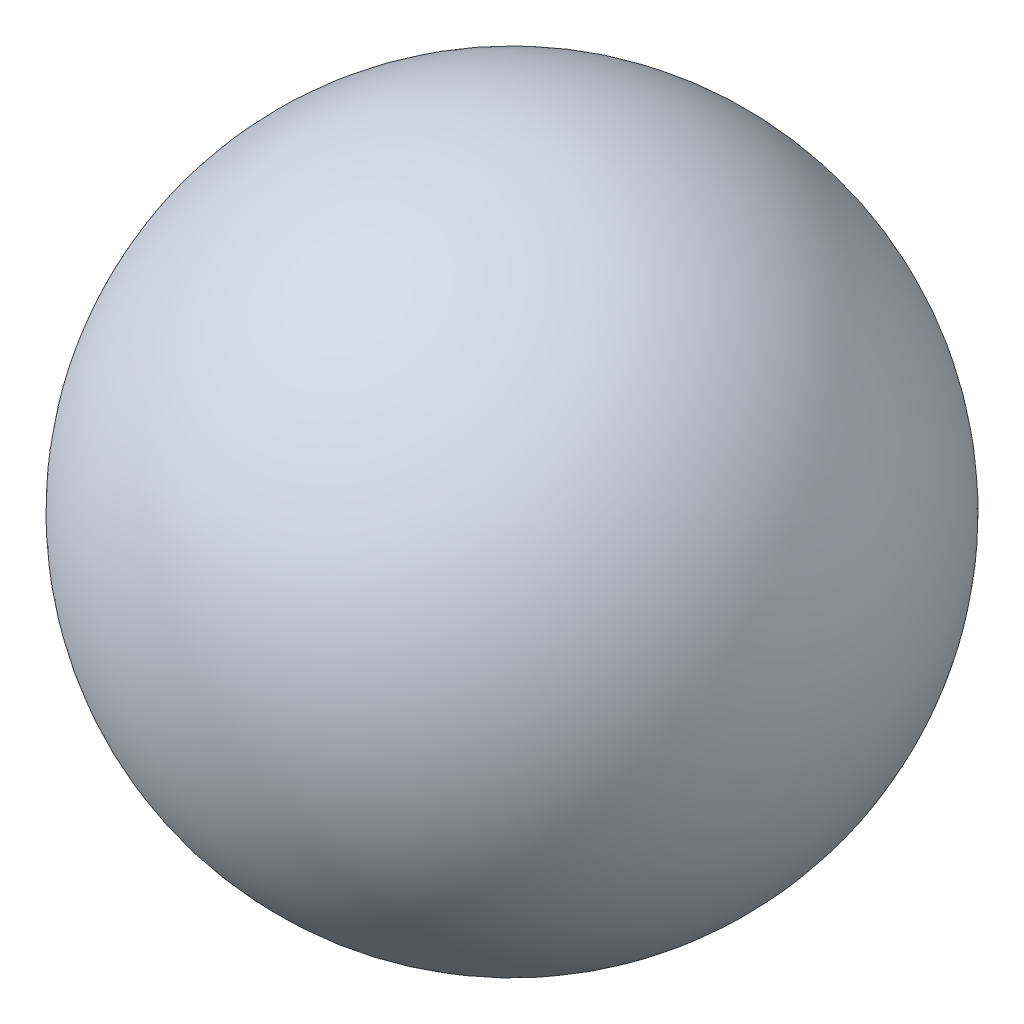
from build123d import *


with BuildPart() as part:
    # Esquisse1 → Base-R_volution (revolve)
    with BuildSketch(Plane(origin=(0, 0, 0), x_dir=(1, 0, 0), z_dir=(0, 1, 0))):
        with BuildLine():
            Line((1.3, 3.7), (6.1, 3.7))
            ThreePointArc((6.1, 3.7), (3.7, 6.1), (1.3, 3.7))
        make_face()
    revolve(axis=Axis((-0.3, 0, -3.7), (1, 0, 0)))


solid = part.part
